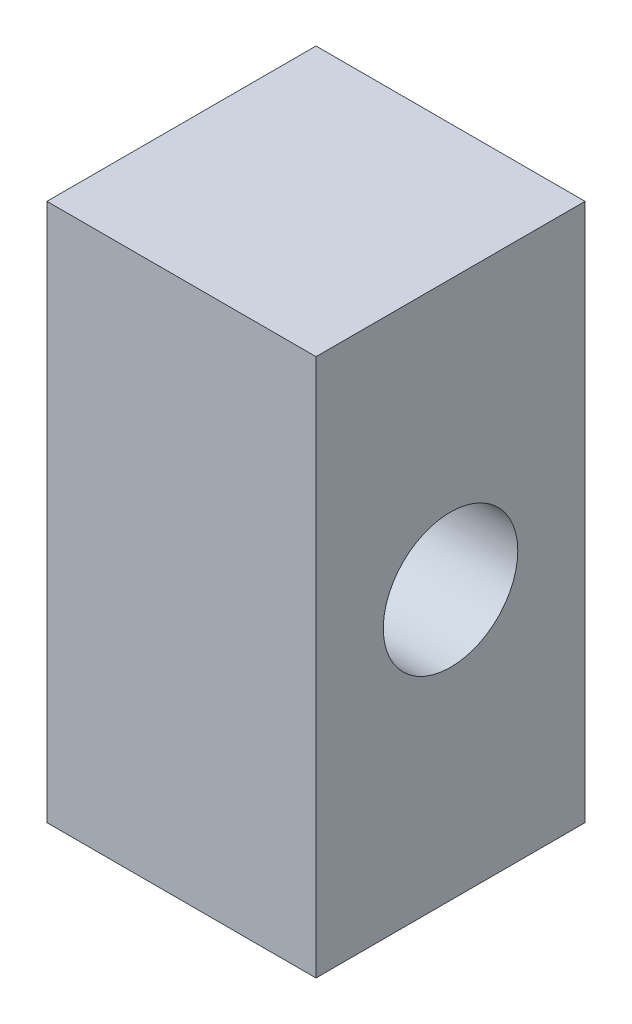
ISO-10303-21;
HEADER;
FILE_DESCRIPTION(('STEP AP214'),'2;1');
FILE_NAME('part.step','',(''),(''),'','','');
FILE_SCHEMA(('AUTOMOTIVE_DESIGN { 1 0 10303 214 1 1 1 1 }'));
ENDSEC;
DATA;
#1=APPLICATION_CONTEXT('core data for automotive mechanical design processes');
#2=APPLICATION_PROTOCOL_DEFINITION('international standard','automotive_design',2000,#1);
#3=PRODUCT_CONTEXT('',#1,'mechanical');
#4=PRODUCT('Part','Part','',(#3));
#5=PRODUCT_RELATED_PRODUCT_CATEGORY('part','',(#4));
#6=PRODUCT_DEFINITION_FORMATION('','',#4);
#7=PRODUCT_DEFINITION_CONTEXT('part definition',#1,'design');
#8=PRODUCT_DEFINITION('design','',#6,#7);
#9=PRODUCT_DEFINITION_SHAPE('','',#8);
#10=(LENGTH_UNIT() NAMED_UNIT(*) SI_UNIT(.MILLI.,.METRE.));
#11=(NAMED_UNIT(*) PLANE_ANGLE_UNIT() SI_UNIT($,.RADIAN.));
#12=(NAMED_UNIT(*) SI_UNIT($,.STERADIAN.) SOLID_ANGLE_UNIT());
#13=UNCERTAINTY_MEASURE_WITH_UNIT(LENGTH_MEASURE(1.E-05),#10,'distance_accuracy_value','');
#14=(GEOMETRIC_REPRESENTATION_CONTEXT(3) GLOBAL_UNCERTAINTY_ASSIGNED_CONTEXT((#13)) GLOBAL_UNIT_ASSIGNED_CONTEXT((#10,
#11,#12)) REPRESENTATION_CONTEXT('',''));
#15=CARTESIAN_POINT('',(0.,0.,0.));
#16=DIRECTION('',(0.,0.,1.));
#17=DIRECTION('',(1.,0.,0.));
#18=AXIS2_PLACEMENT_3D('',#15,#16,#17);
#19=CARTESIAN_POINT('',(-20.,-40.,20.));
#20=DIRECTION('',(1.,0.,0.));
#21=DIRECTION('',(0.,0.,-1.));
#22=AXIS2_PLACEMENT_3D('',#19,#20,#21);
#23=PLANE('',#22);
#24=CARTESIAN_POINT('',(-20.,0.,0.));
#25=DIRECTION('',(1.,0.,0.));
#26=DIRECTION('',(0.,0.,-1.));
#27=AXIS2_PLACEMENT_3D('',#24,#25,#26);
#28=CIRCLE('',#27,10.);
#29=CARTESIAN_POINT('',(-20.,0.,-10.));
#30=VERTEX_POINT('',#29);
#31=EDGE_CURVE('E111',#30,#30,#28,.T.);
#32=ORIENTED_EDGE('',*,*,#31,.T.);
#33=EDGE_LOOP('',(#32));
#34=FACE_BOUND('',#33,.T.);
#35=DIRECTION('',(0.,-1.,0.));
#36=VECTOR('',#35,1.);
#37=CARTESIAN_POINT('',(-20.,-40.,-20.));
#38=LINE('',#37,#36);
#39=CARTESIAN_POINT('',(-20.,40.,-20.));
#40=VERTEX_POINT('',#39);
#41=CARTESIAN_POINT('',(-20.,-40.,-20.));
#42=VERTEX_POINT('',#41);
#43=EDGE_CURVE('E107',#40,#42,#38,.T.);
#44=ORIENTED_EDGE('',*,*,#43,.T.);
#45=DIRECTION('',(0.,0.,-1.));
#46=VECTOR('',#45,1.);
#47=CARTESIAN_POINT('',(-20.,-40.,20.));
#48=LINE('',#47,#46);
#49=CARTESIAN_POINT('',(-20.,-40.,20.));
#50=VERTEX_POINT('',#49);
#51=EDGE_CURVE('E11',#50,#42,#48,.T.);
#52=ORIENTED_EDGE('',*,*,#51,.F.);
#53=DIRECTION('',(0.,-1.,0.));
#54=VECTOR('',#53,1.);
#55=CARTESIAN_POINT('',(-20.,-40.,20.));
#56=LINE('',#55,#54);
#57=CARTESIAN_POINT('',(-20.,40.,20.));
#58=VERTEX_POINT('',#57);
#59=EDGE_CURVE('E91',#58,#50,#56,.T.);
#60=ORIENTED_EDGE('',*,*,#59,.F.);
#61=DIRECTION('',(0.,0.,-1.));
#62=VECTOR('',#61,1.);
#63=CARTESIAN_POINT('',(-20.,40.,20.));
#64=LINE('',#63,#62);
#65=EDGE_CURVE('E103',#58,#40,#64,.T.);
#66=ORIENTED_EDGE('',*,*,#65,.T.);
#67=EDGE_LOOP('',(#44,#52,#60,#66));
#68=FACE_BOUND('',#67,.T.);
#69=ADVANCED_FACE('F39',(#34,#68),#23,.F.);
#70=CARTESIAN_POINT('',(20.,-40.,20.));
#71=DIRECTION('',(0.,1.,0.));
#72=DIRECTION('',(0.,0.,1.));
#73=AXIS2_PLACEMENT_3D('',#70,#71,#72);
#74=PLANE('',#73);
#75=DIRECTION('',(1.,0.,0.));
#76=VECTOR('',#75,1.);
#77=CARTESIAN_POINT('',(20.,-40.,-20.));
#78=LINE('',#77,#76);
#79=CARTESIAN_POINT('',(20.,-40.,-20.));
#80=VERTEX_POINT('',#79);
#81=EDGE_CURVE('E96',#42,#80,#78,.T.);
#82=ORIENTED_EDGE('',*,*,#81,.T.);
#83=DIRECTION('',(0.,0.,-1.));
#84=VECTOR('',#83,1.);
#85=CARTESIAN_POINT('',(20.,-40.,20.));
#86=LINE('',#85,#84);
#87=CARTESIAN_POINT('',(20.,-40.,20.));
#88=VERTEX_POINT('',#87);
#89=EDGE_CURVE('E48',#88,#80,#86,.T.);
#90=ORIENTED_EDGE('',*,*,#89,.F.);
#91=DIRECTION('',(1.,0.,0.));
#92=VECTOR('',#91,1.);
#93=CARTESIAN_POINT('',(20.,-40.,20.));
#94=LINE('',#93,#92);
#95=EDGE_CURVE('E86',#50,#88,#94,.T.);
#96=ORIENTED_EDGE('',*,*,#95,.F.);
#97=ORIENTED_EDGE('',*,*,#51,.T.);
#98=EDGE_LOOP('',(#82,#90,#96,#97));
#99=FACE_BOUND('',#98,.T.);
#100=ADVANCED_FACE('F95',(#99),#74,.F.);
#101=CARTESIAN_POINT('',(20.,-40.,20.));
#102=DIRECTION('',(-1.,0.,0.));
#103=DIRECTION('',(0.,0.,1.));
#104=AXIS2_PLACEMENT_3D('',#101,#102,#103);
#105=PLANE('',#104);
#106=CARTESIAN_POINT('',(20.,0.,0.));
#107=DIRECTION('',(1.,0.,0.));
#108=DIRECTION('',(0.,0.,-1.));
#109=AXIS2_PLACEMENT_3D('',#106,#107,#108);
#110=CIRCLE('',#109,10.);
#111=CARTESIAN_POINT('',(20.,0.,-10.));
#112=VERTEX_POINT('',#111);
#113=EDGE_CURVE('E128',#112,#112,#110,.T.);
#114=ORIENTED_EDGE('',*,*,#113,.F.);
#115=EDGE_LOOP('',(#114));
#116=FACE_BOUND('',#115,.T.);
#117=DIRECTION('',(0.,1.,0.));
#118=VECTOR('',#117,1.);
#119=CARTESIAN_POINT('',(20.,-40.,-20.));
#120=LINE('',#119,#118);
#121=CARTESIAN_POINT('',(20.,40.,-20.));
#122=VERTEX_POINT('',#121);
#123=EDGE_CURVE('E73',#80,#122,#120,.T.);
#124=ORIENTED_EDGE('',*,*,#123,.T.);
#125=DIRECTION('',(0.,0.,-1.));
#126=VECTOR('',#125,1.);
#127=CARTESIAN_POINT('',(20.,40.,20.));
#128=LINE('',#127,#126);
#129=CARTESIAN_POINT('',(20.,40.,20.));
#130=VERTEX_POINT('',#129);
#131=EDGE_CURVE('E98',#130,#122,#128,.T.);
#132=ORIENTED_EDGE('',*,*,#131,.F.);
#133=DIRECTION('',(0.,1.,0.));
#134=VECTOR('',#133,1.);
#135=CARTESIAN_POINT('',(20.,-40.,20.));
#136=LINE('',#135,#134);
#137=EDGE_CURVE('E89',#88,#130,#136,.T.);
#138=ORIENTED_EDGE('',*,*,#137,.F.);
#139=ORIENTED_EDGE('',*,*,#89,.T.);
#140=EDGE_LOOP('',(#124,#132,#138,#139));
#141=FACE_BOUND('',#140,.T.);
#142=ADVANCED_FACE('F99',(#116,#141),#105,.F.);
#143=CARTESIAN_POINT('',(20.,40.,20.));
#144=DIRECTION('',(0.,-1.,0.));
#145=DIRECTION('',(1.,0.,0.));
#146=AXIS2_PLACEMENT_3D('',#143,#144,#145);
#147=PLANE('',#146);
#148=DIRECTION('',(-1.,0.,0.));
#149=VECTOR('',#148,1.);
#150=CARTESIAN_POINT('',(20.,40.,-20.));
#151=LINE('',#150,#149);
#152=EDGE_CURVE('E79',#122,#40,#151,.T.);
#153=ORIENTED_EDGE('',*,*,#152,.T.);
#154=ORIENTED_EDGE('',*,*,#65,.F.);
#155=DIRECTION('',(-1.,0.,0.));
#156=VECTOR('',#155,1.);
#157=CARTESIAN_POINT('',(20.,40.,20.));
#158=LINE('',#157,#156);
#159=EDGE_CURVE('E56',#130,#58,#158,.T.);
#160=ORIENTED_EDGE('',*,*,#159,.F.);
#161=ORIENTED_EDGE('',*,*,#131,.T.);
#162=EDGE_LOOP('',(#153,#154,#160,#161));
#163=FACE_BOUND('',#162,.T.);
#164=ADVANCED_FACE('F121',(#163),#147,.F.);
#165=CARTESIAN_POINT('',(0.,0.,20.));
#166=DIRECTION('',(0.,0.,1.));
#167=DIRECTION('',(1.,0.,0.));
#168=AXIS2_PLACEMENT_3D('',#165,#166,#167);
#169=PLANE('',#168);
#170=ORIENTED_EDGE('',*,*,#59,.T.);
#171=ORIENTED_EDGE('',*,*,#95,.T.);
#172=ORIENTED_EDGE('',*,*,#137,.T.);
#173=ORIENTED_EDGE('',*,*,#159,.T.);
#174=EDGE_LOOP('',(#170,#171,#172,#173));
#175=FACE_BOUND('',#174,.T.);
#176=ADVANCED_FACE('F87',(#175),#169,.T.);
#177=CARTESIAN_POINT('',(0.,0.,-20.));
#178=DIRECTION('',(0.,0.,1.));
#179=DIRECTION('',(1.,0.,0.));
#180=AXIS2_PLACEMENT_3D('',#177,#178,#179);
#181=PLANE('',#180);
#182=ORIENTED_EDGE('',*,*,#43,.F.);
#183=ORIENTED_EDGE('',*,*,#152,.F.);
#184=ORIENTED_EDGE('',*,*,#123,.F.);
#185=ORIENTED_EDGE('',*,*,#81,.F.);
#186=EDGE_LOOP('',(#182,#183,#184,#185));
#187=FACE_BOUND('',#186,.T.);
#188=ADVANCED_FACE('F124',(#187),#181,.F.);
#189=CARTESIAN_POINT('',(-20.,0.,0.));
#190=DIRECTION('',(1.,0.,0.));
#191=DIRECTION('',(0.,0.,-1.));
#192=AXIS2_PLACEMENT_3D('',#189,#190,#191);
#193=CYLINDRICAL_SURFACE('',#192,10.);
#194=ORIENTED_EDGE('',*,*,#31,.F.);
#195=EDGE_LOOP('',(#194));
#196=FACE_BOUND('',#195,.T.);
#197=ORIENTED_EDGE('',*,*,#113,.T.);
#198=EDGE_LOOP('',(#197));
#199=FACE_BOUND('',#198,.T.);
#200=ADVANCED_FACE('F137',(#196,#199),#193,.F.);
#201=CLOSED_SHELL('',(#69,#100,#142,#164,#176,#188,#200));
#202=MANIFOLD_SOLID_BREP('B2',#201);
#203=ADVANCED_BREP_SHAPE_REPRESENTATION('',(#18,#202),#14);
#204=SHAPE_DEFINITION_REPRESENTATION(#9,#203);
ENDSEC;
END-ISO-10303-21;
